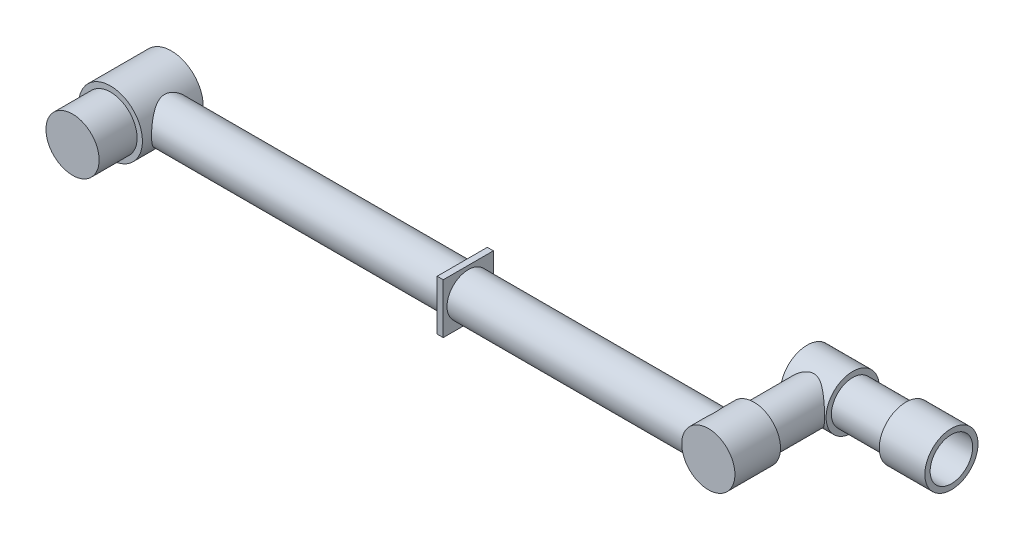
from build123d import *

# Parameters (mm, degrees)
SKETCH1_R           = 210
BOSS_EXTRUDE1_DEPTH = 200
SKETCH4_R           = 175
BOSS_EXTRUDE2_DEPTH = 250
SKETCH5_R           = 140
BOSS_EXTRUDE3_DEPTH = 3885
SKETCH7_R           = 175
BOSS_EXTRUDE4_DEPTH = 150
SKETCH8_R           = 140
BOSS_EXTRUDE5_DEPTH = 500
SKETCH9_R           = 175
BOSS_EXTRUDE6_DEPTH = 150
SKETCH10_R          = 140
BOSS_EXTRUDE7_DEPTH = 500
SKETCH12_R          = 175
BOSS_EXTRUDE8_DEPTH = 150
CUT_EXTRUDE3_START  = -220
SKETCH13_R          = 140
CUT_EXTRUDE3_DEPTH  = 220
SKETCH14_W          = 330
SKETCH14_H          = 330
BOSS_EXTRUDE9_DEPTH = 20


with BuildPart() as part:
    # Sketch1 → Boss-Extrude1 (new, symmetric)
    with BuildSketch(Plane.XY):
        Circle(SKETCH1_R)
    extrude(amount=BOSS_EXTRUDE1_DEPTH, both=True)

    # Sketch4 → Boss-Extrude2 (add)
    with BuildSketch(Plane.XY.offset(200)):
        Circle(SKETCH4_R)
    extrude(amount=BOSS_EXTRUDE2_DEPTH)

    # Sketch5 → Boss-Extrude3 (add)
    with BuildSketch(Plane(origin=(0, 0, 0), x_dir=(0, 0, -1), z_dir=(1, 0, 0))):
        Circle(SKETCH5_R)
    extrude(amount=BOSS_EXTRUDE3_DEPTH)

    # Sketch7 → Boss-Extrude4 (add, symmetric)
    with BuildSketch(Plane.XY):
        with Locations((3885, 0)):
            Circle(SKETCH7_R)
    extrude(amount=BOSS_EXTRUDE4_DEPTH, both=True)

    # Sketch8 → Boss-Extrude5 (add)
    with BuildSketch(Plane(origin=(0, 0, -150), x_dir=(-1, 0, 0), z_dir=(0, 0, -1))):
        with Locations((-3885, 0)):
            Circle(SKETCH8_R)
    extrude(amount=BOSS_EXTRUDE5_DEPTH)

    # Sketch9 → Boss-Extrude6 (add, symmetric)
    with BuildSketch(Plane(origin=(3885, 0, 0), x_dir=(0, 0, -1), z_dir=(1, 0, 0))):
        with Locations((650, 0)):
            Circle(SKETCH9_R)
    extrude(amount=BOSS_EXTRUDE6_DEPTH, both=True)

    # Sketch10 → Boss-Extrude7 (add)
    with BuildSketch(Plane(origin=(4035, 0, 0), x_dir=(0, 0, -1), z_dir=(1, 0, 0))):
        with Locations((650, 0)):
            Circle(SKETCH10_R)
    extrude(amount=BOSS_EXTRUDE7_DEPTH)

    # Sketch12 → Boss-Extrude8 (add, symmetric)
    with BuildSketch(Plane(origin=(4535, 0, 0), x_dir=(0, 0, -1), z_dir=(1, 0, 0))):
        with Locations((650, 0)):
            Circle(SKETCH12_R)
    extrude(amount=BOSS_EXTRUDE8_DEPTH, both=True)

    # Sketch13 → Cut-Extrude3 (cut)
    with BuildSketch(Plane(origin=(4685, 0, 0), x_dir=(0, 0, -1), z_dir=(1, 0, 0)).offset(CUT_EXTRUDE3_START)):
        with Locations((650, 0)):
            Circle(SKETCH13_R)
    extrude(amount=CUT_EXTRUDE3_DEPTH, mode=Mode.SUBTRACT)

    # Sketch14 → Boss-Extrude9 (add, symmetric)
    with BuildSketch(Plane(origin=(2135, 0, 0), x_dir=(0, 0, -1), z_dir=(1, 0, 0))):
        Rectangle(SKETCH14_W, SKETCH14_H)
    extrude(amount=BOSS_EXTRUDE9_DEPTH, both=True)


solid = part.part
